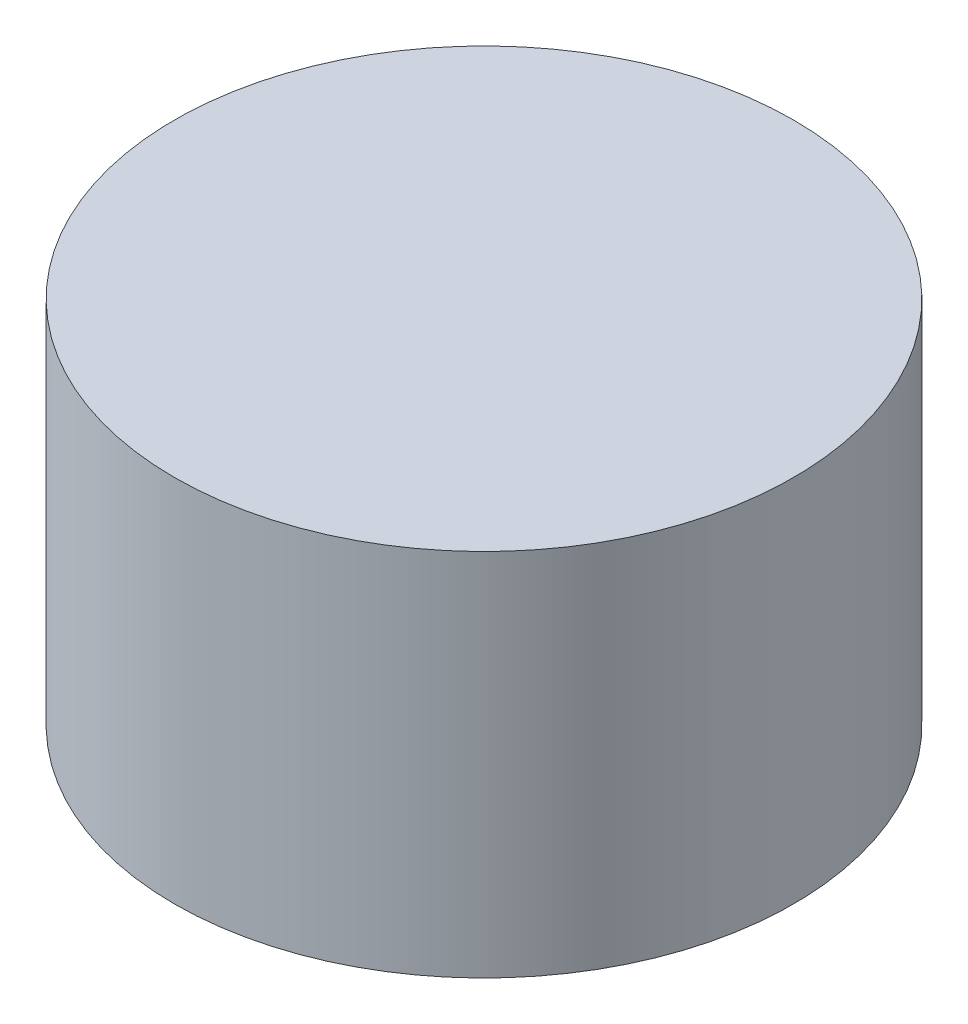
from build123d import *

# Parameters (mm, degrees)
SKIZZE1_R               = 28.497507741
LINEAR_AUSTRAGEN1_DEPTH = 34


with BuildPart() as part:
    # Skizze1 → Linear austragen1 (new body)
    with BuildSketch(Plane(origin=(0, 0, 0), x_dir=(1, 0, 0), z_dir=(0, 1, 0))):
        with Locations(Location((0, 0, 0), (0, 0, 270))):
            Circle(SKIZZE1_R)
    extrude(amount=LINEAR_AUSTRAGEN1_DEPTH)


solid = part.part
